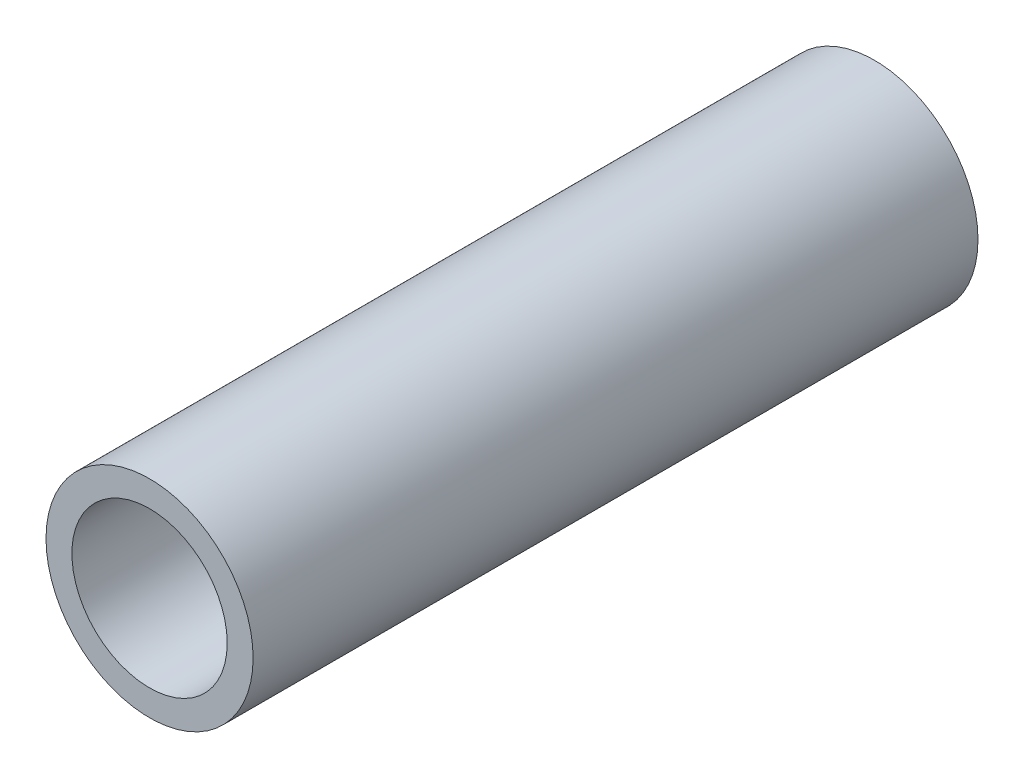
from build123d import *

# Parameters (mm, degrees)
SKETCH1_W = 1.5875
SKETCH1_H = 44.45


with BuildPart() as part:
    # Sketch1 → Tygon Tubing (revolve)
    with BuildSketch(Plane(origin=(0, 0, 0), x_dir=(1, 0, 0), z_dir=(0, 1, 0)), mode=Mode.PRIVATE) as tygon_tubing_sk:
        with Locations((-5.55625, 9.413906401)):
            Rectangle(SKETCH1_W, SKETCH1_H)
    revolve(tygon_tubing_sk.sketch.rotate(Axis((0, 0, 12.811093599), (0, 0, -1)), 180), axis=Axis((0, 0, 12.811093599), (0, 0, -1)))


solid = part.part
